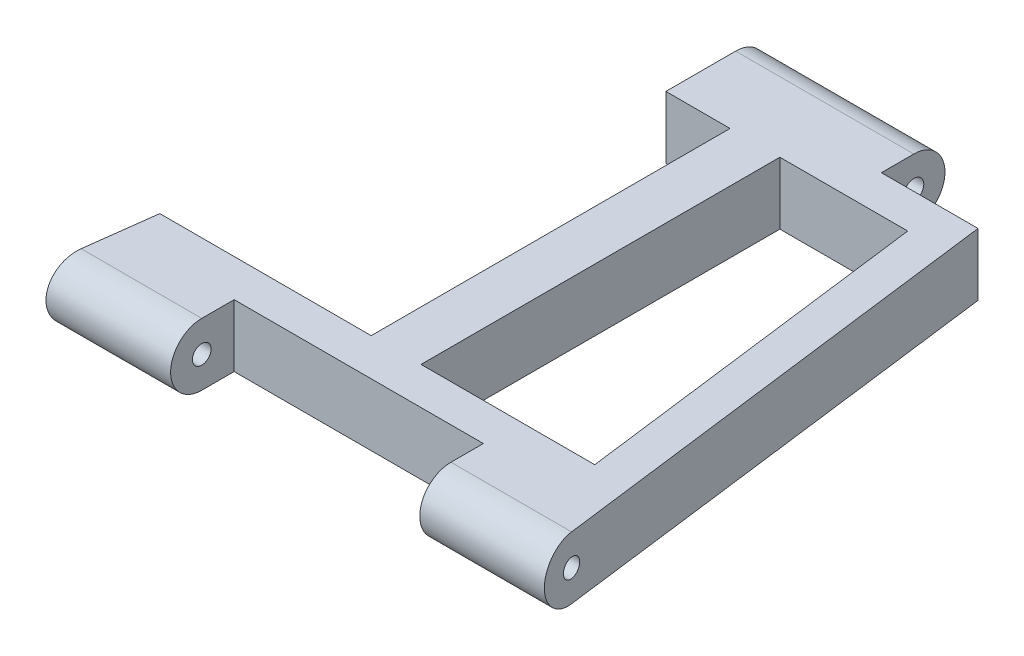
from build123d import *

# Parameters (mm, degrees)
EXTRUDE_1_DEPTH          = 10
SKETCH_2_R               = 1.6
CUT_EXTRUDE_1_DEPTH      = 28.6
CUT_EXTRUDE_2_DEPTH      = 123.489842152
CUT_EXTRUDE_2_DEPTH_BACK = 123.489842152
SKETCH_3_R               = 1.5


with BuildPart() as part:
    # Sketch 1 → Extrude 1 (new body)
    with BuildSketch(Plane(origin=(0, 0, 0), x_dir=(1, 0, 0), z_dir=(0, 1, 0))):
        Polygon((-113.83752184, 106.319148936), (-113.83752184, 90.119148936), (-103.53752184, 90.119148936), (-103.53752184, 32.519148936), (-137.46752184, 32.519148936), (-139.53752184, 16.319148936), (-119.53752184, 16.319148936), (-119.53752184, 26.519148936), (-79.53752184, 26.519148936), (-79.53752184, 16.319148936), (-59.53752184, 16.319148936), (-69.734188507, 96.119148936), (-85.23752184, 96.119148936), (-85.23752184, 106.319148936), align=None)
        Polygon((-75.016305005, 90.119148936), (-67.656305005, 32.519148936), (-95.53752184, 32.519148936), (-95.53752184, 90.119148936), align=None, mode=Mode.SUBTRACT)
    extrude(amount=EXTRUDE_1_DEPTH)

    # Sketch 2 → Cut-Extrude 1 (cut)
    with BuildSketch(Plane.ZY.offset(113.83752184)):
        with Locations((-101.319148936, 5)):
            Circle(SKETCH_2_R)
        with BuildLine():
            Line((-106.319148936, 10), (-106.319148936, 5))
            ThreePointArc((-106.319148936, 5), (-104.854682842, 8.535533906), (-101.319148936, 10))
            Line((-101.319148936, 10), (-106.319148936, 10))
        make_face()
        with BuildLine():
            Line((-106.319148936, 5), (-106.319148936, 0))
            Line((-106.319148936, 0), (-101.319148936, 0))
            ThreePointArc((-101.319148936, 0), (-104.854682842, 1.464466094), (-106.319148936, 5))
        make_face()
    extrude(amount=-CUT_EXTRUDE_1_DEPTH, mode=Mode.SUBTRACT)

    # Sketch 3 → Cut-Extrude 2 (cut, two sides: drawn at the far end of the back side and taken through both)
    with BuildSketch(Plane.ZY.offset(79.53752184).offset(-CUT_EXTRUDE_2_DEPTH_BACK)):
        with Locations(Location((-21.319148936, 5, 0), (0, 0, 180))):
            Circle(SKETCH_3_R)
        with BuildLine():
            Line((-16.319148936, 10), (-21.319148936, 10))
            ThreePointArc((-21.319148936, 10), (-17.78361503, 8.535533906), (-16.319148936, 5))
            Line((-16.319148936, 5), (-16.319148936, 10))
        make_face()
        with BuildLine():
            ThreePointArc((-16.319148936, 5), (-17.78361503, 1.464466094), (-21.319148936, 0))
            Line((-21.319148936, 0), (-16.319148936, 0))
            Line((-16.319148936, 0), (-16.319148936, 5))
        make_face()
    extrude(amount=CUT_EXTRUDE_2_DEPTH + CUT_EXTRUDE_2_DEPTH_BACK, mode=Mode.SUBTRACT)


solid = part.part
